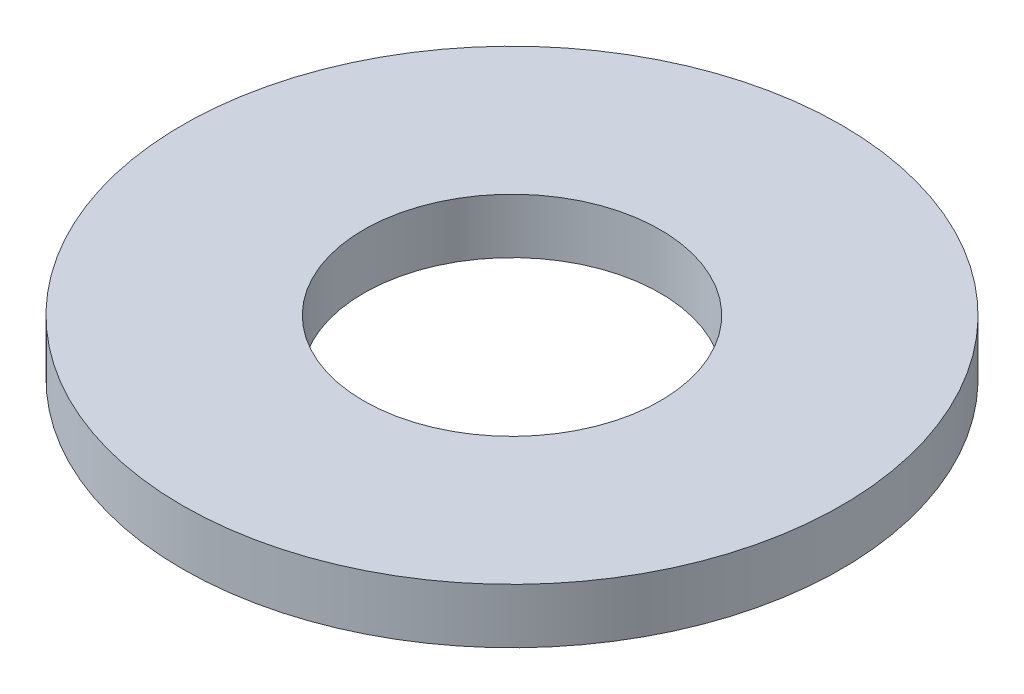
from build123d import *

# Parameters (mm, degrees)
SKETCH1_R      = 3
SKETCH1_R_2    = 1.35
EXTRUDE1_DEPTH = 0.5


with BuildPart() as part:
    # Sketch1 → Extrude1 (new body)
    with BuildSketch(Plane(origin=(0, 0, 0), x_dir=(1, 0, 0), z_dir=(0, 1, 0))):
        with Locations(Location((0, 0, 0), (0, 0, 270))):
            Circle(SKETCH1_R)
        with Locations(Location((0, 0, 0), (0, 0, 270))):
            Circle(SKETCH1_R_2, mode=Mode.SUBTRACT)
    extrude(amount=EXTRUDE1_DEPTH)


solid = part.part
